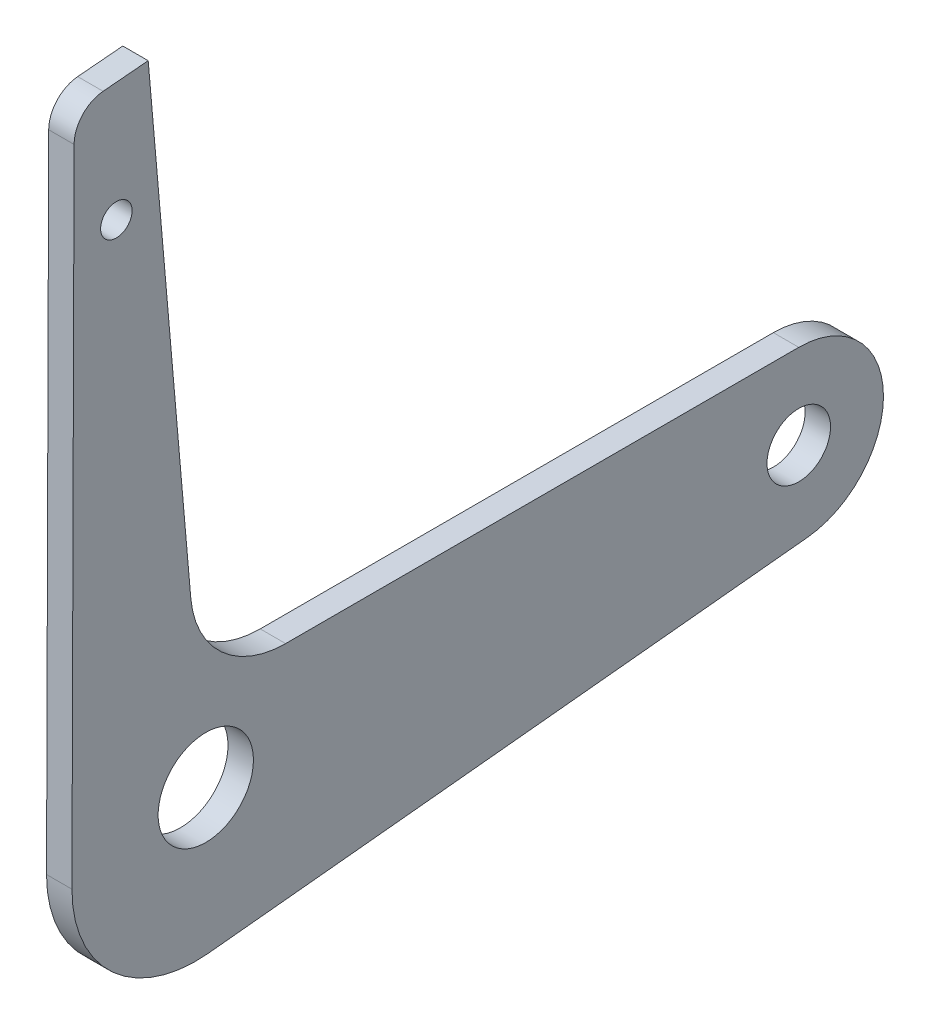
ISO-10303-21;
HEADER;
FILE_DESCRIPTION(('STEP AP214'),'2;1');
FILE_NAME('part.step','',(''),(''),'','','');
FILE_SCHEMA(('AUTOMOTIVE_DESIGN { 1 0 10303 214 1 1 1 1 }'));
ENDSEC;
DATA;
#1=APPLICATION_CONTEXT('core data for automotive mechanical design processes');
#2=APPLICATION_PROTOCOL_DEFINITION('international standard','automotive_design',2000,#1);
#3=PRODUCT_CONTEXT('',#1,'mechanical');
#4=PRODUCT('Part','Part','',(#3));
#5=PRODUCT_RELATED_PRODUCT_CATEGORY('part','',(#4));
#6=PRODUCT_DEFINITION_FORMATION('','',#4);
#7=PRODUCT_DEFINITION_CONTEXT('part definition',#1,'design');
#8=PRODUCT_DEFINITION('design','',#6,#7);
#9=PRODUCT_DEFINITION_SHAPE('','',#8);
#10=(LENGTH_UNIT() NAMED_UNIT(*) SI_UNIT(.MILLI.,.METRE.));
#11=(NAMED_UNIT(*) PLANE_ANGLE_UNIT() SI_UNIT($,.RADIAN.));
#12=(NAMED_UNIT(*) SI_UNIT($,.STERADIAN.) SOLID_ANGLE_UNIT());
#13=UNCERTAINTY_MEASURE_WITH_UNIT(LENGTH_MEASURE(1.E-05),#10,'distance_accuracy_value','');
#14=(GEOMETRIC_REPRESENTATION_CONTEXT(3) GLOBAL_UNCERTAINTY_ASSIGNED_CONTEXT((#13)) GLOBAL_UNIT_ASSIGNED_CONTEXT((#10,
#11,#12)) REPRESENTATION_CONTEXT('',''));
#15=CARTESIAN_POINT('',(0.,0.,0.));
#16=DIRECTION('',(0.,0.,1.));
#17=DIRECTION('',(1.,0.,0.));
#18=AXIS2_PLACEMENT_3D('',#15,#16,#17);
#19=CARTESIAN_POINT('',(-1.905,13.4874,-5.98466910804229));
#20=DIRECTION('',(1.,0.,0.));
#21=DIRECTION('',(0.,0.,-1.));
#22=AXIS2_PLACEMENT_3D('',#19,#20,#21);
#23=CYLINDRICAL_SURFACE('',#22,7.1374);
#24=CARTESIAN_POINT('',(0.,13.4874,-5.98466910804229));
#25=DIRECTION('',(-1.,0.,0.));
#26=DIRECTION('',(0.,0.,-1.));
#27=AXIS2_PLACEMENT_3D('',#24,#25,#26);
#28=CIRCLE('',#27,7.1374);
#29=CARTESIAN_POINT('',(0.,6.35,-5.98466910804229));
#30=VERTEX_POINT('',#29);
#31=CARTESIAN_POINT('',(0.,12.8653346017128,1.12557093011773));
#32=VERTEX_POINT('',#31);
#33=EDGE_CURVE('E150',#30,#32,#28,.T.);
#34=ORIENTED_EDGE('',*,*,#33,.F.);
#35=DIRECTION('',(1.,0.,0.));
#36=VECTOR('',#35,1.);
#37=CARTESIAN_POINT('',(-1.905,6.35,-5.98466910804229));
#38=LINE('',#37,#36);
#39=CARTESIAN_POINT('',(-1.905,6.35,-5.98466910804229));
#40=VERTEX_POINT('',#39);
#41=EDGE_CURVE('E13',#40,#30,#38,.T.);
#42=ORIENTED_EDGE('',*,*,#41,.F.);
#43=CARTESIAN_POINT('',(-1.905,13.4874,-5.98466910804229));
#44=DIRECTION('',(-1.,0.,0.));
#45=DIRECTION('',(0.,0.,-1.));
#46=AXIS2_PLACEMENT_3D('',#43,#44,#45);
#47=CIRCLE('',#46,7.1374);
#48=CARTESIAN_POINT('',(-1.905,12.8653346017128,1.12557093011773));
#49=VERTEX_POINT('',#48);
#50=EDGE_CURVE('E174',#40,#49,#47,.T.);
#51=ORIENTED_EDGE('',*,*,#50,.T.);
#52=DIRECTION('',(1.,0.,0.));
#53=VECTOR('',#52,1.);
#54=CARTESIAN_POINT('',(-1.905,12.8653346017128,1.12557093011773));
#55=LINE('',#54,#53);
#56=EDGE_CURVE('E50',#49,#32,#55,.T.);
#57=ORIENTED_EDGE('',*,*,#56,.T.);
#58=EDGE_LOOP('',(#34,#42,#51,#57));
#59=FACE_BOUND('',#58,.T.);
#60=ADVANCED_FACE('F47',(#59),#23,.F.);
#61=CARTESIAN_POINT('',(-1.905,6.35,-5.98466910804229));
#62=DIRECTION('',(0.,1.,0.));
#63=DIRECTION('',(0.,0.,1.));
#64=AXIS2_PLACEMENT_3D('',#61,#62,#63);
#65=PLANE('',#64);
#66=DIRECTION('',(0.,0.,1.));
#67=VECTOR('',#66,1.);
#68=CARTESIAN_POINT('',(0.,6.35,-5.98466910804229));
#69=LINE('',#68,#67);
#70=CARTESIAN_POINT('',(0.,6.35,-44.45));
#71=VERTEX_POINT('',#70);
#72=EDGE_CURVE('E172',#71,#30,#69,.T.);
#73=ORIENTED_EDGE('',*,*,#72,.F.);
#74=DIRECTION('',(1.,0.,0.));
#75=VECTOR('',#74,1.);
#76=CARTESIAN_POINT('',(-1.905,6.35,-44.45));
#77=LINE('',#76,#75);
#78=CARTESIAN_POINT('',(-1.905,6.35,-44.45));
#79=VERTEX_POINT('',#78);
#80=EDGE_CURVE('E56',#79,#71,#77,.T.);
#81=ORIENTED_EDGE('',*,*,#80,.F.);
#82=DIRECTION('',(0.,0.,1.));
#83=VECTOR('',#82,1.);
#84=CARTESIAN_POINT('',(-1.905,6.35,-5.98466910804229));
#85=LINE('',#84,#83);
#86=EDGE_CURVE('E140',#79,#40,#85,.T.);
#87=ORIENTED_EDGE('',*,*,#86,.T.);
#88=ORIENTED_EDGE('',*,*,#41,.T.);
#89=EDGE_LOOP('',(#73,#81,#87,#88));
#90=FACE_BOUND('',#89,.T.);
#91=ADVANCED_FACE('F188',(#90),#65,.T.);
#92=CARTESIAN_POINT('',(-1.905,0.,-44.45));
#93=DIRECTION('',(1.,0.,0.));
#94=DIRECTION('',(0.,0.,-1.));
#95=AXIS2_PLACEMENT_3D('',#92,#93,#94);
#96=CYLINDRICAL_SURFACE('',#95,6.35);
#97=CARTESIAN_POINT('',(0.,0.,-44.45));
#98=DIRECTION('',(1.,0.,0.));
#99=DIRECTION('',(0.,0.,-1.));
#100=AXIS2_PLACEMENT_3D('',#97,#98,#99);
#101=CIRCLE('',#100,6.35);
#102=CARTESIAN_POINT('',(0.,-6.31777418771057,-45.0889282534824));
#103=VERTEX_POINT('',#102);
#104=EDGE_CURVE('E127',#103,#71,#101,.T.);
#105=ORIENTED_EDGE('',*,*,#104,.F.);
#106=DIRECTION('',(1.,0.,0.));
#107=VECTOR('',#106,1.);
#108=CARTESIAN_POINT('',(-1.905,-6.31777418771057,-45.0889282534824));
#109=LINE('',#108,#107);
#110=CARTESIAN_POINT('',(-1.905,-6.31777418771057,-45.0889282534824));
#111=VERTEX_POINT('',#110);
#112=EDGE_CURVE('E122',#111,#103,#109,.T.);
#113=ORIENTED_EDGE('',*,*,#112,.F.);
#114=CARTESIAN_POINT('',(-1.905,0.,-44.45));
#115=DIRECTION('',(1.,0.,0.));
#116=DIRECTION('',(0.,0.,-1.));
#117=AXIS2_PLACEMENT_3D('',#114,#115,#116);
#118=CIRCLE('',#117,6.35);
#119=EDGE_CURVE('E125',#111,#79,#118,.T.);
#120=ORIENTED_EDGE('',*,*,#119,.T.);
#121=ORIENTED_EDGE('',*,*,#80,.T.);
#122=EDGE_LOOP('',(#105,#113,#120,#121));
#123=FACE_BOUND('',#122,.T.);
#124=ADVANCED_FACE('F124',(#123),#96,.T.);
#125=CARTESIAN_POINT('',(-1.905,-10.8585,-0.189864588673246));
#126=DIRECTION('',(0.,-0.994925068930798,-0.100618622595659));
#127=DIRECTION('',(0.,0.100618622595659,-0.994925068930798));
#128=AXIS2_PLACEMENT_3D('',#125,#126,#127);
#129=PLANE('',#128);
#130=DIRECTION('',(0.,0.100618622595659,-0.994925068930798));
#131=VECTOR('',#130,1.);
#132=CARTESIAN_POINT('',(0.,-10.8585,-0.189864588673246));
#133=LINE('',#132,#131);
#134=CARTESIAN_POINT('',(0.,-10.8585,-0.189864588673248));
#135=VERTEX_POINT('',#134);
#136=EDGE_CURVE('E169',#135,#103,#133,.T.);
#137=ORIENTED_EDGE('',*,*,#136,.F.);
#138=DIRECTION('',(1.,0.,0.));
#139=VECTOR('',#138,1.);
#140=CARTESIAN_POINT('',(-1.905,-10.8585,-0.189864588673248));
#141=LINE('',#140,#139);
#142=CARTESIAN_POINT('',(-1.905,-10.8585,-0.189864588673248));
#143=VERTEX_POINT('',#142);
#144=EDGE_CURVE('E132',#143,#135,#141,.T.);
#145=ORIENTED_EDGE('',*,*,#144,.F.);
#146=DIRECTION('',(0.,0.100618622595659,-0.994925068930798));
#147=VECTOR('',#146,1.);
#148=CARTESIAN_POINT('',(-1.905,-10.8585,-0.189864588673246));
#149=LINE('',#148,#147);
#150=EDGE_CURVE('E138',#143,#111,#149,.T.);
#151=ORIENTED_EDGE('',*,*,#150,.T.);
#152=ORIENTED_EDGE('',*,*,#112,.T.);
#153=EDGE_LOOP('',(#137,#145,#151,#152));
#154=FACE_BOUND('',#153,.T.);
#155=ADVANCED_FACE('F142',(#154),#129,.T.);
#156=CARTESIAN_POINT('',(-1.905,-1.61730100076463,0.744715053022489));
#157=DIRECTION('',(1.,0.,0.));
#158=DIRECTION('',(0.,0.,-1.));
#159=AXIS2_PLACEMENT_3D('',#156,#157,#158);
#160=CYLINDRICAL_SURFACE('',#159,9.28833666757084);
#161=CARTESIAN_POINT('',(0.,-1.61730100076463,0.744715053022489));
#162=DIRECTION('',(1.,0.,0.));
#163=DIRECTION('',(0.,0.,-1.));
#164=AXIS2_PLACEMENT_3D('',#161,#162,#163);
#165=CIRCLE('',#164,9.28833666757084);
#166=CARTESIAN_POINT('',(0.,-1.58630432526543,10.033));
#167=VERTEX_POINT('',#166);
#168=EDGE_CURVE('E166',#167,#135,#165,.T.);
#169=ORIENTED_EDGE('',*,*,#168,.F.);
#170=DIRECTION('',(1.,0.,0.));
#171=VECTOR('',#170,1.);
#172=CARTESIAN_POINT('',(-1.905,-1.58630432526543,10.033));
#173=LINE('',#172,#171);
#174=CARTESIAN_POINT('',(-1.905,-1.58630432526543,10.033));
#175=VERTEX_POINT('',#174);
#176=EDGE_CURVE('E178',#175,#167,#173,.T.);
#177=ORIENTED_EDGE('',*,*,#176,.F.);
#178=CARTESIAN_POINT('',(-1.905,-1.61730100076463,0.744715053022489));
#179=DIRECTION('',(1.,0.,0.));
#180=DIRECTION('',(0.,0.,-1.));
#181=AXIS2_PLACEMENT_3D('',#178,#179,#180);
#182=CIRCLE('',#181,9.28833666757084);
#183=EDGE_CURVE('E143',#175,#143,#182,.T.);
#184=ORIENTED_EDGE('',*,*,#183,.T.);
#185=ORIENTED_EDGE('',*,*,#144,.T.);
#186=EDGE_LOOP('',(#169,#177,#184,#185));
#187=FACE_BOUND('',#186,.T.);
#188=ADVANCED_FACE('F201',(#187),#160,.T.);
#189=CARTESIAN_POINT('',(-1.905,46.6814471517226,9.87192184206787));
#190=DIRECTION('',(0.,0.00333716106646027,0.999994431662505));
#191=DIRECTION('',(0.,-0.999994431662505,0.00333716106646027));
#192=AXIS2_PLACEMENT_3D('',#189,#190,#191);
#193=PLANE('',#192);
#194=DIRECTION('',(0.,-0.999994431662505,0.00333716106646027));
#195=VECTOR('',#194,1.);
#196=CARTESIAN_POINT('',(0.,46.6814471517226,9.87192184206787));
#197=LINE('',#196,#195);
#198=CARTESIAN_POINT('',(0.,46.6814471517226,9.87192184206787));
#199=VERTEX_POINT('',#198);
#200=EDGE_CURVE('E163',#199,#167,#197,.T.);
#201=ORIENTED_EDGE('',*,*,#200,.F.);
#202=DIRECTION('',(1.,0.,0.));
#203=VECTOR('',#202,1.);
#204=CARTESIAN_POINT('',(-1.905,46.6814471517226,9.87192184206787));
#205=LINE('',#204,#203);
#206=CARTESIAN_POINT('',(-1.905,46.6814471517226,9.87192184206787));
#207=VERTEX_POINT('',#206);
#208=EDGE_CURVE('E180',#207,#199,#205,.T.);
#209=ORIENTED_EDGE('',*,*,#208,.F.);
#210=DIRECTION('',(0.,-0.999994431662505,0.00333716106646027));
#211=VECTOR('',#210,1.);
#212=CARTESIAN_POINT('',(-1.905,46.6814471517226,9.87192184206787));
#213=LINE('',#212,#211);
#214=EDGE_CURVE('E145',#207,#175,#213,.T.);
#215=ORIENTED_EDGE('',*,*,#214,.T.);
#216=ORIENTED_EDGE('',*,*,#176,.T.);
#217=EDGE_LOOP('',(#201,#209,#215,#216));
#218=FACE_BOUND('',#217,.T.);
#219=ADVANCED_FACE('F204',(#218),#193,.T.);
#220=CARTESIAN_POINT('',(-1.905,46.6735005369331,7.49068510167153));
#221=DIRECTION('',(1.,0.,0.));
#222=DIRECTION('',(0.,0.,-1.));
#223=AXIS2_PLACEMENT_3D('',#220,#221,#222);
#224=CYLINDRICAL_SURFACE('',#223,2.38125);
#225=CARTESIAN_POINT('',(0.,46.6735005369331,7.49068510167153));
#226=DIRECTION('',(1.,0.,0.));
#227=DIRECTION('',(0.,0.,-1.));
#228=AXIS2_PLACEMENT_3D('',#225,#226,#227);
#229=CIRCLE('',#228,2.38125);
#230=CARTESIAN_POINT('',(0.,49.0456891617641,7.6982247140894));
#231=VERTEX_POINT('',#230);
#232=EDGE_CURVE('E160',#231,#199,#229,.T.);
#233=ORIENTED_EDGE('',*,*,#232,.F.);
#234=DIRECTION('',(1.,0.,0.));
#235=VECTOR('',#234,1.);
#236=CARTESIAN_POINT('',(-1.905,49.0456891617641,7.6982247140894));
#237=LINE('',#236,#235);
#238=CARTESIAN_POINT('',(-1.905,49.0456891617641,7.6982247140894));
#239=VERTEX_POINT('',#238);
#240=EDGE_CURVE('E182',#239,#231,#237,.T.);
#241=ORIENTED_EDGE('',*,*,#240,.F.);
#242=CARTESIAN_POINT('',(-1.905,46.6735005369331,7.49068510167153));
#243=DIRECTION('',(1.,0.,0.));
#244=DIRECTION('',(0.,0.,-1.));
#245=AXIS2_PLACEMENT_3D('',#242,#243,#244);
#246=CIRCLE('',#245,2.38125);
#247=EDGE_CURVE('E267',#239,#207,#246,.T.);
#248=ORIENTED_EDGE('',*,*,#247,.T.);
#249=ORIENTED_EDGE('',*,*,#208,.T.);
#250=EDGE_LOOP('',(#233,#241,#248,#249));
#251=FACE_BOUND('',#250,.T.);
#252=ADVANCED_FACE('F208',(#251),#224,.T.);
#253=CARTESIAN_POINT('',(-1.905,49.3415233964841,4.31682393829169));
#254=DIRECTION('',(0.,0.996194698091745,0.0871557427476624));
#255=DIRECTION('',(0.,-0.0871557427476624,0.996194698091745));
#256=AXIS2_PLACEMENT_3D('',#253,#254,#255);
#257=PLANE('',#256);
#258=DIRECTION('',(0.,-0.0871557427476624,0.996194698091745));
#259=VECTOR('',#258,1.);
#260=CARTESIAN_POINT('',(0.,49.3415233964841,4.31682393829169));
#261=LINE('',#260,#259);
#262=CARTESIAN_POINT('',(0.,49.3415233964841,4.31682393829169));
#263=VERTEX_POINT('',#262);
#264=EDGE_CURVE('E157',#263,#231,#261,.T.);
#265=ORIENTED_EDGE('',*,*,#264,.F.);
#266=DIRECTION('',(1.,0.,0.));
#267=VECTOR('',#266,1.);
#268=CARTESIAN_POINT('',(-1.905,49.3415233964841,4.31682393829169));
#269=LINE('',#268,#267);
#270=CARTESIAN_POINT('',(-1.905,49.3415233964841,4.31682393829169));
#271=VERTEX_POINT('',#270);
#272=EDGE_CURVE('E183',#271,#263,#269,.T.);
#273=ORIENTED_EDGE('',*,*,#272,.F.);
#274=DIRECTION('',(0.,-0.0871557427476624,0.996194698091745));
#275=VECTOR('',#274,1.);
#276=CARTESIAN_POINT('',(-1.905,49.3415233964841,4.31682393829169));
#277=LINE('',#276,#275);
#278=EDGE_CURVE('E264',#271,#239,#277,.T.);
#279=ORIENTED_EDGE('',*,*,#278,.T.);
#280=ORIENTED_EDGE('',*,*,#240,.T.);
#281=EDGE_LOOP('',(#265,#273,#279,#280));
#282=FACE_BOUND('',#281,.T.);
#283=ADVANCED_FACE('F212',(#282),#257,.T.);
#284=CARTESIAN_POINT('',(-1.905,12.8653346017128,1.12557093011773));
#285=DIRECTION('',(0.,0.0871557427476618,-0.996194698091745));
#286=DIRECTION('',(0.,0.996194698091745,0.0871557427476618));
#287=AXIS2_PLACEMENT_3D('',#284,#285,#286);
#288=PLANE('',#287);
#289=DIRECTION('',(0.,0.996194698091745,0.0871557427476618));
#290=VECTOR('',#289,1.);
#291=CARTESIAN_POINT('',(0.,12.8653346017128,1.12557093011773));
#292=LINE('',#291,#290);
#293=EDGE_CURVE('E153',#32,#263,#292,.T.);
#294=ORIENTED_EDGE('',*,*,#293,.F.);
#295=ORIENTED_EDGE('',*,*,#56,.F.);
#296=DIRECTION('',(0.,0.996194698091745,0.0871557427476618));
#297=VECTOR('',#296,1.);
#298=CARTESIAN_POINT('',(-1.905,12.8653346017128,1.12557093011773));
#299=LINE('',#298,#297);
#300=EDGE_CURVE('E262',#49,#271,#299,.T.);
#301=ORIENTED_EDGE('',*,*,#300,.T.);
#302=ORIENTED_EDGE('',*,*,#272,.T.);
#303=EDGE_LOOP('',(#294,#295,#301,#302));
#304=FACE_BOUND('',#303,.T.);
#305=ADVANCED_FACE('F185',(#304),#288,.T.);
#306=CARTESIAN_POINT('',(-1.905,13.4874,-5.98466910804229));
#307=DIRECTION('',(1.,0.,0.));
#308=DIRECTION('',(0.,0.,-1.));
#309=AXIS2_PLACEMENT_3D('',#306,#307,#308);
#310=PLANE('',#309);
#311=CARTESIAN_POINT('',(-1.905,40.2086330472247,6.70492755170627));
#312=DIRECTION('',(1.,0.,0.));
#313=DIRECTION('',(0.,0.,-1.));
#314=AXIS2_PLACEMENT_3D('',#311,#312,#313);
#315=CIRCLE('',#314,1.1811);
#316=CARTESIAN_POINT('',(-1.905,40.2086330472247,5.52382755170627));
#317=VERTEX_POINT('',#316);
#318=EDGE_CURVE('E243',#317,#317,#315,.T.);
#319=ORIENTED_EDGE('',*,*,#318,.T.);
#320=EDGE_LOOP('',(#319));
#321=FACE_BOUND('',#320,.T.);
#322=CARTESIAN_POINT('',(-1.905,0.,-44.45));
#323=DIRECTION('',(1.,0.,0.));
#324=DIRECTION('',(0.,0.,-1.));
#325=AXIS2_PLACEMENT_3D('',#322,#323,#324);
#326=CIRCLE('',#325,2.38125);
#327=CARTESIAN_POINT('',(-1.905,0.,-46.83125));
#328=VERTEX_POINT('',#327);
#329=EDGE_CURVE('E251',#328,#328,#326,.T.);
#330=ORIENTED_EDGE('',*,*,#329,.T.);
#331=EDGE_LOOP('',(#330));
#332=FACE_BOUND('',#331,.T.);
#333=CARTESIAN_POINT('',(-1.905,0.,0.));
#334=DIRECTION('',(1.,0.,0.));
#335=DIRECTION('',(0.,0.,-1.));
#336=AXIS2_PLACEMENT_3D('',#333,#334,#335);
#337=CIRCLE('',#336,3.571875);
#338=CARTESIAN_POINT('',(-1.905,0.,-3.571875));
#339=VERTEX_POINT('',#338);
#340=EDGE_CURVE('E154',#339,#339,#337,.T.);
#341=ORIENTED_EDGE('',*,*,#340,.T.);
#342=EDGE_LOOP('',(#341));
#343=FACE_BOUND('',#342,.T.);
#344=ORIENTED_EDGE('',*,*,#50,.F.);
#345=ORIENTED_EDGE('',*,*,#86,.F.);
#346=ORIENTED_EDGE('',*,*,#119,.F.);
#347=ORIENTED_EDGE('',*,*,#150,.F.);
#348=ORIENTED_EDGE('',*,*,#183,.F.);
#349=ORIENTED_EDGE('',*,*,#214,.F.);
#350=ORIENTED_EDGE('',*,*,#247,.F.);
#351=ORIENTED_EDGE('',*,*,#278,.F.);
#352=ORIENTED_EDGE('',*,*,#300,.F.);
#353=EDGE_LOOP('',(#344,#345,#346,#347,#348,#349,#350,#351,#352));
#354=FACE_BOUND('',#353,.T.);
#355=ADVANCED_FACE('F136',(#321,#332,#343,#354),#310,.F.);
#356=CARTESIAN_POINT('',(0.,13.4874,-5.98466910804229));
#357=DIRECTION('',(1.,0.,0.));
#358=DIRECTION('',(0.,0.,-1.));
#359=AXIS2_PLACEMENT_3D('',#356,#357,#358);
#360=PLANE('',#359);
#361=CARTESIAN_POINT('',(0.,40.2086330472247,6.70492755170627));
#362=DIRECTION('',(1.,0.,0.));
#363=DIRECTION('',(0.,0.,-1.));
#364=AXIS2_PLACEMENT_3D('',#361,#362,#363);
#365=CIRCLE('',#364,1.1811);
#366=CARTESIAN_POINT('',(0.,40.2086330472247,5.52382755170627));
#367=VERTEX_POINT('',#366);
#368=EDGE_CURVE('E246',#367,#367,#365,.T.);
#369=ORIENTED_EDGE('',*,*,#368,.F.);
#370=EDGE_LOOP('',(#369));
#371=FACE_BOUND('',#370,.T.);
#372=CARTESIAN_POINT('',(0.,0.,-44.45));
#373=DIRECTION('',(1.,0.,0.));
#374=DIRECTION('',(0.,0.,-1.));
#375=AXIS2_PLACEMENT_3D('',#372,#373,#374);
#376=CIRCLE('',#375,2.38125);
#377=CARTESIAN_POINT('',(0.,0.,-46.83125));
#378=VERTEX_POINT('',#377);
#379=EDGE_CURVE('E248',#378,#378,#376,.T.);
#380=ORIENTED_EDGE('',*,*,#379,.F.);
#381=EDGE_LOOP('',(#380));
#382=FACE_BOUND('',#381,.T.);
#383=CARTESIAN_POINT('',(0.,0.,0.));
#384=DIRECTION('',(1.,0.,0.));
#385=DIRECTION('',(0.,0.,-1.));
#386=AXIS2_PLACEMENT_3D('',#383,#384,#385);
#387=CIRCLE('',#386,3.571875);
#388=CARTESIAN_POINT('',(0.,0.,-3.571875));
#389=VERTEX_POINT('',#388);
#390=EDGE_CURVE('E254',#389,#389,#387,.T.);
#391=ORIENTED_EDGE('',*,*,#390,.F.);
#392=EDGE_LOOP('',(#391));
#393=FACE_BOUND('',#392,.T.);
#394=ORIENTED_EDGE('',*,*,#33,.T.);
#395=ORIENTED_EDGE('',*,*,#293,.T.);
#396=ORIENTED_EDGE('',*,*,#264,.T.);
#397=ORIENTED_EDGE('',*,*,#232,.T.);
#398=ORIENTED_EDGE('',*,*,#200,.T.);
#399=ORIENTED_EDGE('',*,*,#168,.T.);
#400=ORIENTED_EDGE('',*,*,#136,.T.);
#401=ORIENTED_EDGE('',*,*,#104,.T.);
#402=ORIENTED_EDGE('',*,*,#72,.T.);
#403=EDGE_LOOP('',(#394,#395,#396,#397,#398,#399,#400,#401,#402));
#404=FACE_BOUND('',#403,.T.);
#405=ADVANCED_FACE('F187',(#371,#382,#393,#404),#360,.T.);
#406=CARTESIAN_POINT('',(-1.905,0.,0.));
#407=DIRECTION('',(1.,0.,0.));
#408=DIRECTION('',(0.,0.,-1.));
#409=AXIS2_PLACEMENT_3D('',#406,#407,#408);
#410=CYLINDRICAL_SURFACE('',#409,3.571875);
#411=CARTESIAN_POINT('',(-1.905,0.,-3.571875));
#412=CARTESIAN_POINT('',(-1.88515625,0.,-3.571875));
#413=CARTESIAN_POINT('',(-1.8653125,0.,-3.571875));
#414=CARTESIAN_POINT('',(-1.825625,0.,-3.571875));
#415=CARTESIAN_POINT('',(-1.80578125,0.,-3.571875));
#416=CARTESIAN_POINT('',(-1.76609375,0.,-3.571875));
#417=CARTESIAN_POINT('',(-1.74625,0.,-3.571875));
#418=CARTESIAN_POINT('',(-1.7065625,0.,-3.571875));
#419=CARTESIAN_POINT('',(-1.68671875,0.,-3.571875));
#420=CARTESIAN_POINT('',(-1.64703125,0.,-3.571875));
#421=CARTESIAN_POINT('',(-1.6271875,0.,-3.571875));
#422=CARTESIAN_POINT('',(-1.5875,0.,-3.571875));
#423=CARTESIAN_POINT('',(-1.56765625,0.,-3.571875));
#424=CARTESIAN_POINT('',(-1.52796875,0.,-3.571875));
#425=CARTESIAN_POINT('',(-1.508125,0.,-3.571875));
#426=CARTESIAN_POINT('',(-1.4684375,0.,-3.571875));
#427=CARTESIAN_POINT('',(-1.44859375,0.,-3.571875));
#428=CARTESIAN_POINT('',(-1.40890625,0.,-3.571875));
#429=CARTESIAN_POINT('',(-1.3890625,0.,-3.571875));
#430=CARTESIAN_POINT('',(-1.349375,0.,-3.571875));
#431=CARTESIAN_POINT('',(-1.32953125,0.,-3.571875));
#432=CARTESIAN_POINT('',(-1.28984375,0.,-3.571875));
#433=CARTESIAN_POINT('',(-1.27,0.,-3.571875));
#434=CARTESIAN_POINT('',(-1.2303125,0.,-3.571875));
#435=CARTESIAN_POINT('',(-1.21046875,0.,-3.571875));
#436=CARTESIAN_POINT('',(-1.17078125,0.,-3.571875));
#437=CARTESIAN_POINT('',(-1.1509375,0.,-3.571875));
#438=CARTESIAN_POINT('',(-1.11125,0.,-3.571875));
#439=CARTESIAN_POINT('',(-1.09140625,0.,-3.571875));
#440=CARTESIAN_POINT('',(-1.05171875,0.,-3.571875));
#441=CARTESIAN_POINT('',(-1.031875,0.,-3.571875));
#442=CARTESIAN_POINT('',(-0.9921875,0.,-3.571875));
#443=CARTESIAN_POINT('',(-0.97234375,0.,-3.571875));
#444=CARTESIAN_POINT('',(-0.93265625,0.,-3.571875));
#445=CARTESIAN_POINT('',(-0.9128125,0.,-3.571875));
#446=CARTESIAN_POINT('',(-0.873125,0.,-3.571875));
#447=CARTESIAN_POINT('',(-0.85328125,0.,-3.571875));
#448=CARTESIAN_POINT('',(-0.81359375,0.,-3.571875));
#449=CARTESIAN_POINT('',(-0.79375,0.,-3.571875));
#450=CARTESIAN_POINT('',(-0.7540625,0.,-3.571875));
#451=CARTESIAN_POINT('',(-0.73421875,0.,-3.571875));
#452=CARTESIAN_POINT('',(-0.69453125,0.,-3.571875));
#453=CARTESIAN_POINT('',(-0.6746875,0.,-3.571875));
#454=CARTESIAN_POINT('',(-0.635,0.,-3.571875));
#455=CARTESIAN_POINT('',(-0.61515625,0.,-3.571875));
#456=CARTESIAN_POINT('',(-0.57546875,0.,-3.571875));
#457=CARTESIAN_POINT('',(-0.555625,0.,-3.571875));
#458=CARTESIAN_POINT('',(-0.5159375,0.,-3.571875));
#459=CARTESIAN_POINT('',(-0.49609375,0.,-3.571875));
#460=CARTESIAN_POINT('',(-0.45640625,0.,-3.571875));
#461=CARTESIAN_POINT('',(-0.4365625,0.,-3.571875));
#462=CARTESIAN_POINT('',(-0.396875,0.,-3.571875));
#463=CARTESIAN_POINT('',(-0.37703125,0.,-3.571875));
#464=CARTESIAN_POINT('',(-0.33734375,0.,-3.571875));
#465=CARTESIAN_POINT('',(-0.3175,0.,-3.571875));
#466=CARTESIAN_POINT('',(-0.2778125,0.,-3.571875));
#467=CARTESIAN_POINT('',(-0.25796875,0.,-3.571875));
#468=CARTESIAN_POINT('',(-0.21828125,0.,-3.571875));
#469=CARTESIAN_POINT('',(-0.1984375,0.,-3.571875));
#470=CARTESIAN_POINT('',(-0.15875,0.,-3.571875));
#471=CARTESIAN_POINT('',(-0.13890625,0.,-3.571875));
#472=CARTESIAN_POINT('',(-0.09921875,0.,-3.571875));
#473=CARTESIAN_POINT('',(-0.0793749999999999,0.,-3.571875));
#474=CARTESIAN_POINT('',(-0.0396874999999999,0.,-3.571875));
#475=CARTESIAN_POINT('',(-0.01984375,0.,-3.571875));
#476=CARTESIAN_POINT('',(0.,0.,-3.571875));
#477=B_SPLINE_CURVE_WITH_KNOTS('',3,(#411,#412,#413,#414,#415,#416,#417,#418,#419,#420,#421,
#422,#423,#424,#425,#426,#427,#428,#429,#430,#431,#432,#433,#434,#435,#436,#437,#438,#439,#440,
#441,#442,#443,#444,#445,#446,#447,#448,#449,#450,#451,#452,#453,#454,#455,#456,#457,#458,#459,
#460,#461,#462,#463,#464,#465,#466,#467,#468,#469,#470,#471,#472,#473,#474,#475,#476),
.UNSPECIFIED.,.F.,.F.,(4,2,2,2,2,2,2,2,2,2,2,2,2,2,2,2,2,2,2,2,2,2,2,2,2,2,2,2,2,2,2,2,4),(0.,
0.0595312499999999,0.1190625,0.17859375,0.238125,0.29765625,0.3571875,0.41671875,0.47625,
0.53578125,0.5953125,0.65484375,0.714375,0.77390625,0.8334375,0.89296875,0.9525,1.01203125,
1.0715625,1.13109375,1.190625,1.25015625,1.3096875,1.36921875,1.42875,1.48828125,1.5478125,
1.60734375,1.666875,1.72640625,1.7859375,1.84546875,1.905),.UNSPECIFIED.);
#478=EDGE_CURVE('BSEAM224',#339,#389,#477,.T.);
#479=ORIENTED_EDGE('',*,*,#340,.F.);
#480=ORIENTED_EDGE('',*,*,#390,.T.);
#481=ORIENTED_EDGE('',*,*,#478,.T.);
#482=ORIENTED_EDGE('',*,*,#478,.F.);
#483=EDGE_LOOP('',(#479,#481,#480,#482));
#484=FACE_BOUND('',#483,.T.);
#485=ADVANCED_FACE('F224',(#484),#410,.F.);
#486=CARTESIAN_POINT('',(-1.905,0.,-44.45));
#487=DIRECTION('',(1.,0.,0.));
#488=DIRECTION('',(0.,0.,-1.));
#489=AXIS2_PLACEMENT_3D('',#486,#487,#488);
#490=CYLINDRICAL_SURFACE('',#489,2.38125);
#491=CARTESIAN_POINT('',(-1.905,0.,-46.83125));
#492=CARTESIAN_POINT('',(-1.88515625,0.,-46.83125));
#493=CARTESIAN_POINT('',(-1.8653125,0.,-46.83125));
#494=CARTESIAN_POINT('',(-1.825625,0.,-46.83125));
#495=CARTESIAN_POINT('',(-1.80578125,0.,-46.83125));
#496=CARTESIAN_POINT('',(-1.76609375,0.,-46.83125));
#497=CARTESIAN_POINT('',(-1.74625,0.,-46.83125));
#498=CARTESIAN_POINT('',(-1.7065625,0.,-46.83125));
#499=CARTESIAN_POINT('',(-1.68671875,0.,-46.83125));
#500=CARTESIAN_POINT('',(-1.64703125,0.,-46.83125));
#501=CARTESIAN_POINT('',(-1.6271875,0.,-46.83125));
#502=CARTESIAN_POINT('',(-1.5875,0.,-46.83125));
#503=CARTESIAN_POINT('',(-1.56765625,0.,-46.83125));
#504=CARTESIAN_POINT('',(-1.52796875,0.,-46.83125));
#505=CARTESIAN_POINT('',(-1.508125,0.,-46.83125));
#506=CARTESIAN_POINT('',(-1.4684375,0.,-46.83125));
#507=CARTESIAN_POINT('',(-1.44859375,0.,-46.83125));
#508=CARTESIAN_POINT('',(-1.40890625,0.,-46.83125));
#509=CARTESIAN_POINT('',(-1.3890625,0.,-46.83125));
#510=CARTESIAN_POINT('',(-1.349375,0.,-46.83125));
#511=CARTESIAN_POINT('',(-1.32953125,0.,-46.83125));
#512=CARTESIAN_POINT('',(-1.28984375,0.,-46.83125));
#513=CARTESIAN_POINT('',(-1.27,0.,-46.83125));
#514=CARTESIAN_POINT('',(-1.2303125,0.,-46.83125));
#515=CARTESIAN_POINT('',(-1.21046875,0.,-46.83125));
#516=CARTESIAN_POINT('',(-1.17078125,0.,-46.83125));
#517=CARTESIAN_POINT('',(-1.1509375,0.,-46.83125));
#518=CARTESIAN_POINT('',(-1.11125,0.,-46.83125));
#519=CARTESIAN_POINT('',(-1.09140625,0.,-46.83125));
#520=CARTESIAN_POINT('',(-1.05171875,0.,-46.83125));
#521=CARTESIAN_POINT('',(-1.031875,0.,-46.83125));
#522=CARTESIAN_POINT('',(-0.9921875,0.,-46.83125));
#523=CARTESIAN_POINT('',(-0.97234375,0.,-46.83125));
#524=CARTESIAN_POINT('',(-0.93265625,0.,-46.83125));
#525=CARTESIAN_POINT('',(-0.9128125,0.,-46.83125));
#526=CARTESIAN_POINT('',(-0.873125,0.,-46.83125));
#527=CARTESIAN_POINT('',(-0.85328125,0.,-46.83125));
#528=CARTESIAN_POINT('',(-0.81359375,0.,-46.83125));
#529=CARTESIAN_POINT('',(-0.79375,0.,-46.83125));
#530=CARTESIAN_POINT('',(-0.7540625,0.,-46.83125));
#531=CARTESIAN_POINT('',(-0.73421875,0.,-46.83125));
#532=CARTESIAN_POINT('',(-0.69453125,0.,-46.83125));
#533=CARTESIAN_POINT('',(-0.6746875,0.,-46.83125));
#534=CARTESIAN_POINT('',(-0.635,0.,-46.83125));
#535=CARTESIAN_POINT('',(-0.61515625,0.,-46.83125));
#536=CARTESIAN_POINT('',(-0.57546875,0.,-46.83125));
#537=CARTESIAN_POINT('',(-0.555625,0.,-46.83125));
#538=CARTESIAN_POINT('',(-0.5159375,0.,-46.83125));
#539=CARTESIAN_POINT('',(-0.49609375,0.,-46.83125));
#540=CARTESIAN_POINT('',(-0.45640625,0.,-46.83125));
#541=CARTESIAN_POINT('',(-0.4365625,0.,-46.83125));
#542=CARTESIAN_POINT('',(-0.396875,0.,-46.83125));
#543=CARTESIAN_POINT('',(-0.37703125,0.,-46.83125));
#544=CARTESIAN_POINT('',(-0.33734375,0.,-46.83125));
#545=CARTESIAN_POINT('',(-0.3175,0.,-46.83125));
#546=CARTESIAN_POINT('',(-0.2778125,0.,-46.83125));
#547=CARTESIAN_POINT('',(-0.25796875,0.,-46.83125));
#548=CARTESIAN_POINT('',(-0.21828125,0.,-46.83125));
#549=CARTESIAN_POINT('',(-0.1984375,0.,-46.83125));
#550=CARTESIAN_POINT('',(-0.15875,0.,-46.83125));
#551=CARTESIAN_POINT('',(-0.13890625,0.,-46.83125));
#552=CARTESIAN_POINT('',(-0.09921875,0.,-46.83125));
#553=CARTESIAN_POINT('',(-0.0793749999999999,0.,-46.83125));
#554=CARTESIAN_POINT('',(-0.0396874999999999,0.,-46.83125));
#555=CARTESIAN_POINT('',(-0.01984375,0.,-46.83125));
#556=CARTESIAN_POINT('',(0.,0.,-46.83125));
#557=B_SPLINE_CURVE_WITH_KNOTS('',3,(#491,#492,#493,#494,#495,#496,#497,#498,#499,#500,#501,
#502,#503,#504,#505,#506,#507,#508,#509,#510,#511,#512,#513,#514,#515,#516,#517,#518,#519,#520,
#521,#522,#523,#524,#525,#526,#527,#528,#529,#530,#531,#532,#533,#534,#535,#536,#537,#538,#539,
#540,#541,#542,#543,#544,#545,#546,#547,#548,#549,#550,#551,#552,#553,#554,#555,#556),
.UNSPECIFIED.,.F.,.F.,(4,2,2,2,2,2,2,2,2,2,2,2,2,2,2,2,2,2,2,2,2,2,2,2,2,2,2,2,2,2,2,2,4),(0.,
0.0595312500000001,0.1190625,0.17859375,0.238125,0.29765625,0.3571875,0.41671875,0.47625,
0.53578125,0.5953125,0.65484375,0.714375,0.77390625,0.8334375,0.89296875,0.9525,1.01203125,
1.0715625,1.13109375,1.190625,1.25015625,1.3096875,1.36921875,1.42875,1.48828125,1.5478125,
1.60734375,1.666875,1.72640625,1.7859375,1.84546875,1.905),.UNSPECIFIED.);
#558=EDGE_CURVE('BSEAM231',#328,#378,#557,.T.);
#559=ORIENTED_EDGE('',*,*,#329,.F.);
#560=ORIENTED_EDGE('',*,*,#379,.T.);
#561=ORIENTED_EDGE('',*,*,#558,.T.);
#562=ORIENTED_EDGE('',*,*,#558,.F.);
#563=EDGE_LOOP('',(#559,#561,#560,#562));
#564=FACE_BOUND('',#563,.T.);
#565=ADVANCED_FACE('F231',(#564),#490,.F.);
#566=CARTESIAN_POINT('',(-1.905,40.2086330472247,6.70492755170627));
#567=DIRECTION('',(1.,0.,0.));
#568=DIRECTION('',(0.,0.,-1.));
#569=AXIS2_PLACEMENT_3D('',#566,#567,#568);
#570=CYLINDRICAL_SURFACE('',#569,1.1811);
#571=CARTESIAN_POINT('',(-1.905,40.2086330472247,5.52382755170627));
#572=CARTESIAN_POINT('',(-1.88515625,40.2086330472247,5.52382755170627));
#573=CARTESIAN_POINT('',(-1.8653125,40.2086330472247,5.52382755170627));
#574=CARTESIAN_POINT('',(-1.825625,40.2086330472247,5.52382755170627));
#575=CARTESIAN_POINT('',(-1.80578125,40.2086330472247,5.52382755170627));
#576=CARTESIAN_POINT('',(-1.76609375,40.2086330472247,5.52382755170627));
#577=CARTESIAN_POINT('',(-1.74625,40.2086330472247,5.52382755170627));
#578=CARTESIAN_POINT('',(-1.7065625,40.2086330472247,5.52382755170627));
#579=CARTESIAN_POINT('',(-1.68671875,40.2086330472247,5.52382755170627));
#580=CARTESIAN_POINT('',(-1.64703125,40.2086330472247,5.52382755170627));
#581=CARTESIAN_POINT('',(-1.6271875,40.2086330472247,5.52382755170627));
#582=CARTESIAN_POINT('',(-1.5875,40.2086330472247,5.52382755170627));
#583=CARTESIAN_POINT('',(-1.56765625,40.2086330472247,5.52382755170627));
#584=CARTESIAN_POINT('',(-1.52796875,40.2086330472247,5.52382755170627));
#585=CARTESIAN_POINT('',(-1.508125,40.2086330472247,5.52382755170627));
#586=CARTESIAN_POINT('',(-1.4684375,40.2086330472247,5.52382755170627));
#587=CARTESIAN_POINT('',(-1.44859375,40.2086330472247,5.52382755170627));
#588=CARTESIAN_POINT('',(-1.40890625,40.2086330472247,5.52382755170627));
#589=CARTESIAN_POINT('',(-1.3890625,40.2086330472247,5.52382755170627));
#590=CARTESIAN_POINT('',(-1.349375,40.2086330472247,5.52382755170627));
#591=CARTESIAN_POINT('',(-1.32953125,40.2086330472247,5.52382755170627));
#592=CARTESIAN_POINT('',(-1.28984375,40.2086330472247,5.52382755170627));
#593=CARTESIAN_POINT('',(-1.27,40.2086330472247,5.52382755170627));
#594=CARTESIAN_POINT('',(-1.2303125,40.2086330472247,5.52382755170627));
#595=CARTESIAN_POINT('',(-1.21046875,40.2086330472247,5.52382755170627));
#596=CARTESIAN_POINT('',(-1.17078125,40.2086330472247,5.52382755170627));
#597=CARTESIAN_POINT('',(-1.1509375,40.2086330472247,5.52382755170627));
#598=CARTESIAN_POINT('',(-1.11125,40.2086330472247,5.52382755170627));
#599=CARTESIAN_POINT('',(-1.09140625,40.2086330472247,5.52382755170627));
#600=CARTESIAN_POINT('',(-1.05171875,40.2086330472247,5.52382755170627));
#601=CARTESIAN_POINT('',(-1.031875,40.2086330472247,5.52382755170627));
#602=CARTESIAN_POINT('',(-0.9921875,40.2086330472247,5.52382755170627));
#603=CARTESIAN_POINT('',(-0.97234375,40.2086330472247,5.52382755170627));
#604=CARTESIAN_POINT('',(-0.93265625,40.2086330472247,5.52382755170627));
#605=CARTESIAN_POINT('',(-0.9128125,40.2086330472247,5.52382755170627));
#606=CARTESIAN_POINT('',(-0.873125,40.2086330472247,5.52382755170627));
#607=CARTESIAN_POINT('',(-0.85328125,40.2086330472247,5.52382755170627));
#608=CARTESIAN_POINT('',(-0.81359375,40.2086330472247,5.52382755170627));
#609=CARTESIAN_POINT('',(-0.79375,40.2086330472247,5.52382755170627));
#610=CARTESIAN_POINT('',(-0.7540625,40.2086330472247,5.52382755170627));
#611=CARTESIAN_POINT('',(-0.73421875,40.2086330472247,5.52382755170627));
#612=CARTESIAN_POINT('',(-0.69453125,40.2086330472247,5.52382755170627));
#613=CARTESIAN_POINT('',(-0.6746875,40.2086330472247,5.52382755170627));
#614=CARTESIAN_POINT('',(-0.635,40.2086330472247,5.52382755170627));
#615=CARTESIAN_POINT('',(-0.61515625,40.2086330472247,5.52382755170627));
#616=CARTESIAN_POINT('',(-0.57546875,40.2086330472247,5.52382755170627));
#617=CARTESIAN_POINT('',(-0.555625,40.2086330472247,5.52382755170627));
#618=CARTESIAN_POINT('',(-0.5159375,40.2086330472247,5.52382755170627));
#619=CARTESIAN_POINT('',(-0.49609375,40.2086330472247,5.52382755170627));
#620=CARTESIAN_POINT('',(-0.45640625,40.2086330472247,5.52382755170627));
#621=CARTESIAN_POINT('',(-0.4365625,40.2086330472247,5.52382755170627));
#622=CARTESIAN_POINT('',(-0.396875,40.2086330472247,5.52382755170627));
#623=CARTESIAN_POINT('',(-0.37703125,40.2086330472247,5.52382755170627));
#624=CARTESIAN_POINT('',(-0.33734375,40.2086330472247,5.52382755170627));
#625=CARTESIAN_POINT('',(-0.3175,40.2086330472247,5.52382755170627));
#626=CARTESIAN_POINT('',(-0.2778125,40.2086330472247,5.52382755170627));
#627=CARTESIAN_POINT('',(-0.25796875,40.2086330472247,5.52382755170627));
#628=CARTESIAN_POINT('',(-0.21828125,40.2086330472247,5.52382755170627));
#629=CARTESIAN_POINT('',(-0.1984375,40.2086330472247,5.52382755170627));
#630=CARTESIAN_POINT('',(-0.15875,40.2086330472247,5.52382755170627));
#631=CARTESIAN_POINT('',(-0.13890625,40.2086330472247,5.52382755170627));
#632=CARTESIAN_POINT('',(-0.09921875,40.2086330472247,5.52382755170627));
#633=CARTESIAN_POINT('',(-0.0793749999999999,40.2086330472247,5.52382755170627));
#634=CARTESIAN_POINT('',(-0.0396874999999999,40.2086330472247,5.52382755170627));
#635=CARTESIAN_POINT('',(-0.01984375,40.2086330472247,5.52382755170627));
#636=CARTESIAN_POINT('',(0.,40.2086330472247,5.52382755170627));
#637=B_SPLINE_CURVE_WITH_KNOTS('',3,(#571,#572,#573,#574,#575,#576,#577,#578,#579,#580,#581,
#582,#583,#584,#585,#586,#587,#588,#589,#590,#591,#592,#593,#594,#595,#596,#597,#598,#599,#600,
#601,#602,#603,#604,#605,#606,#607,#608,#609,#610,#611,#612,#613,#614,#615,#616,#617,#618,#619,
#620,#621,#622,#623,#624,#625,#626,#627,#628,#629,#630,#631,#632,#633,#634,#635,#636),
.UNSPECIFIED.,.F.,.F.,(4,2,2,2,2,2,2,2,2,2,2,2,2,2,2,2,2,2,2,2,2,2,2,2,2,2,2,2,2,2,2,2,4),(0.,
0.0595312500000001,0.1190625,0.17859375,0.238125,0.29765625,0.3571875,0.41671875,0.47625,
0.53578125,0.5953125,0.65484375,0.714375,0.77390625,0.8334375,0.89296875,0.9525,1.01203125,
1.0715625,1.13109375,1.190625,1.25015625,1.3096875,1.36921875,1.42875,1.48828125,1.5478125,
1.60734375,1.666875,1.72640625,1.7859375,1.84546875,1.905),.UNSPECIFIED.);
#638=EDGE_CURVE('BSEAM235',#317,#367,#637,.T.);
#639=ORIENTED_EDGE('',*,*,#318,.F.);
#640=ORIENTED_EDGE('',*,*,#368,.T.);
#641=ORIENTED_EDGE('',*,*,#638,.T.);
#642=ORIENTED_EDGE('',*,*,#638,.F.);
#643=EDGE_LOOP('',(#639,#641,#640,#642));
#644=FACE_BOUND('',#643,.T.);
#645=ADVANCED_FACE('F235',(#644),#570,.F.);
#646=CLOSED_SHELL('',(#60,#91,#124,#155,#188,#219,#252,#283,#305,#355,#405,#485,#565,#645));
#647=MANIFOLD_SOLID_BREP('B2',#646);
#648=ADVANCED_BREP_SHAPE_REPRESENTATION('',(#18,#647),#14);
#649=SHAPE_DEFINITION_REPRESENTATION(#9,#648);
ENDSEC;
END-ISO-10303-21;
